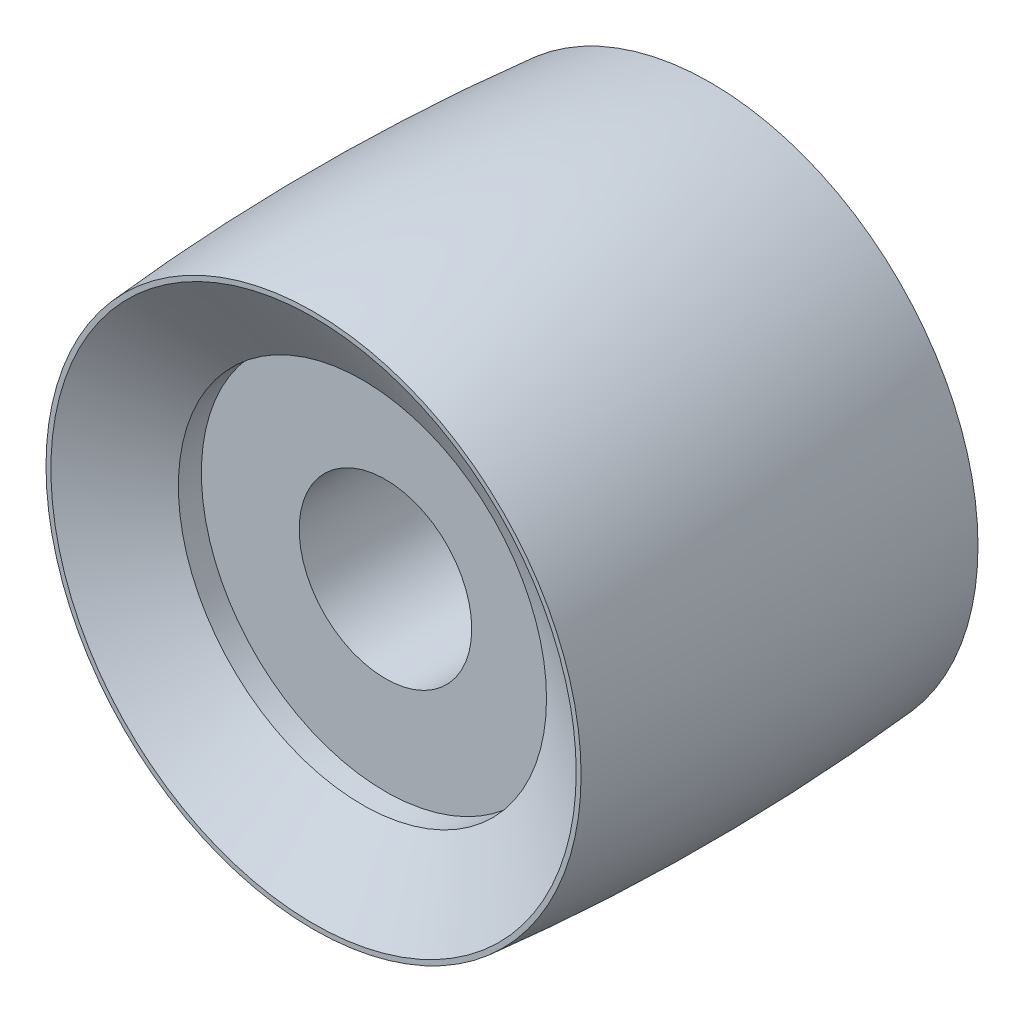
ISO-10303-21;
HEADER;
FILE_DESCRIPTION(('STEP AP214'),'2;1');
FILE_NAME('part.step','',(''),(''),'','','');
FILE_SCHEMA(('AUTOMOTIVE_DESIGN { 1 0 10303 214 1 1 1 1 }'));
ENDSEC;
DATA;
#1=APPLICATION_CONTEXT('core data for automotive mechanical design processes');
#2=APPLICATION_PROTOCOL_DEFINITION('international standard','automotive_design',2000,#1);
#3=PRODUCT_CONTEXT('',#1,'mechanical');
#4=PRODUCT('Part','Part','',(#3));
#5=PRODUCT_RELATED_PRODUCT_CATEGORY('part','',(#4));
#6=PRODUCT_DEFINITION_FORMATION('','',#4);
#7=PRODUCT_DEFINITION_CONTEXT('part definition',#1,'design');
#8=PRODUCT_DEFINITION('design','',#6,#7);
#9=PRODUCT_DEFINITION_SHAPE('','',#8);
#10=(LENGTH_UNIT() NAMED_UNIT(*) SI_UNIT(.MILLI.,.METRE.));
#11=(NAMED_UNIT(*) PLANE_ANGLE_UNIT() SI_UNIT($,.RADIAN.));
#12=(NAMED_UNIT(*) SI_UNIT($,.STERADIAN.) SOLID_ANGLE_UNIT());
#13=UNCERTAINTY_MEASURE_WITH_UNIT(LENGTH_MEASURE(1.E-05),#10,'distance_accuracy_value','');
#14=(GEOMETRIC_REPRESENTATION_CONTEXT(3) GLOBAL_UNCERTAINTY_ASSIGNED_CONTEXT((#13)) GLOBAL_UNIT_ASSIGNED_CONTEXT((#10,
#11,#12)) REPRESENTATION_CONTEXT('',''));
#15=CARTESIAN_POINT('',(0.,0.,0.));
#16=DIRECTION('',(0.,0.,1.));
#17=DIRECTION('',(1.,0.,0.));
#18=AXIS2_PLACEMENT_3D('',#15,#16,#17);
#19=CARTESIAN_POINT('',(0.,0.,0.));
#20=DIRECTION('',(0.,0.,1.));
#21=DIRECTION('',(1.,0.,0.));
#22=AXIS2_PLACEMENT_3D('',#19,#20,#21);
#23=DEGENERATE_TOROIDAL_SURFACE('',#22,176.000000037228,200.000000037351,.F.);
#24=CARTESIAN_POINT('',(0.,0.,17.2500000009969));
#25=DIRECTION('',(0.,0.,1.));
#26=DIRECTION('',(1.,0.,0.));
#27=AXIS2_PLACEMENT_3D('',#24,#25,#26);
#28=CIRCLE('',#27,23.2547050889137);
#29=CARTESIAN_POINT('',(23.2547050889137,0.,17.2500000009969));
#30=VERTEX_POINT('',#29);
#31=EDGE_CURVE('E16',#30,#30,#28,.F.);
#32=ORIENTED_EDGE('',*,*,#31,.T.);
#33=EDGE_LOOP('',(#32));
#34=FACE_BOUND('',#33,.T.);
#35=CARTESIAN_POINT('',(0.,0.,-17.2500000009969));
#36=DIRECTION('',(0.,0.,1.));
#37=DIRECTION('',(1.,0.,0.));
#38=AXIS2_PLACEMENT_3D('',#35,#36,#37);
#39=CIRCLE('',#38,23.2547050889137);
#40=CARTESIAN_POINT('',(23.2547050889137,0.,-17.2500000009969));
#41=VERTEX_POINT('',#40);
#42=EDGE_CURVE('E42',#41,#41,#39,.T.);
#43=ORIENTED_EDGE('',*,*,#42,.T.);
#44=EDGE_LOOP('',(#43));
#45=FACE_BOUND('',#44,.T.);
#46=ADVANCED_FACE('F12',(#34,#45),#23,.F.);
#47=CARTESIAN_POINT('',(23.53376155,-23.614740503,17.25));
#48=DIRECTION('',(0.,0.,-1.));
#49=DIRECTION('',(-1.,0.,0.));
#50=AXIS2_PLACEMENT_3D('',#47,#48,#49);
#51=PLANE('',#50);
#52=CARTESIAN_POINT('',(0.,0.,17.25));
#53=DIRECTION('',(0.,0.,1.));
#54=DIRECTION('',(1.,0.,0.));
#55=AXIS2_PLACEMENT_3D('',#52,#53,#54);
#56=CIRCLE('',#55,22.830357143);
#57=CARTESIAN_POINT('',(22.830357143,0.,17.25));
#58=VERTEX_POINT('',#57);
#59=EDGE_CURVE('E40',#58,#58,#56,.F.);
#60=ORIENTED_EDGE('',*,*,#59,.T.);
#61=EDGE_LOOP('',(#60));
#62=FACE_BOUND('',#61,.T.);
#63=ORIENTED_EDGE('',*,*,#31,.F.);
#64=EDGE_LOOP('',(#63));
#65=FACE_BOUND('',#64,.T.);
#66=ADVANCED_FACE('F50',(#62,#65),#51,.F.);
#67=CARTESIAN_POINT('',(-23.53376155,-23.614740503,-17.25));
#68=DIRECTION('',(0.,0.,1.));
#69=DIRECTION('',(1.,0.,0.));
#70=AXIS2_PLACEMENT_3D('',#67,#68,#69);
#71=PLANE('',#70);
#72=CARTESIAN_POINT('',(0.,0.,-17.25));
#73=DIRECTION('',(0.,0.,-1.));
#74=DIRECTION('',(-1.,0.,0.));
#75=AXIS2_PLACEMENT_3D('',#72,#73,#74);
#76=CIRCLE('',#75,22.830357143);
#77=CARTESIAN_POINT('',(-22.830357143,0.,-17.25));
#78=VERTEX_POINT('',#77);
#79=EDGE_CURVE('E37',#78,#78,#76,.F.);
#80=ORIENTED_EDGE('',*,*,#79,.T.);
#81=EDGE_LOOP('',(#80));
#82=FACE_BOUND('',#81,.T.);
#83=ORIENTED_EDGE('',*,*,#42,.F.);
#84=EDGE_LOOP('',(#83));
#85=FACE_BOUND('',#84,.T.);
#86=ADVANCED_FACE('F52',(#82,#85),#71,.F.);
#87=CARTESIAN_POINT('',(0.,0.,13.));
#88=DIRECTION('',(0.,0.,1.));
#89=DIRECTION('',(1.,0.,0.));
#90=AXIS2_PLACEMENT_3D('',#87,#88,#89);
#91=CONICAL_SURFACE('',#90,16.,1.01419700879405);
#92=CARTESIAN_POINT('',(0.,0.,13.));
#93=DIRECTION('',(0.,0.,1.));
#94=DIRECTION('',(1.,0.,0.));
#95=AXIS2_PLACEMENT_3D('',#92,#93,#94);
#96=CIRCLE('',#95,16.);
#97=CARTESIAN_POINT('',(16.,0.,13.));
#98=VERTEX_POINT('',#97);
#99=EDGE_CURVE('E28',#98,#98,#96,.F.);
#100=ORIENTED_EDGE('',*,*,#99,.T.);
#101=EDGE_LOOP('',(#100));
#102=FACE_BOUND('',#101,.T.);
#103=ORIENTED_EDGE('',*,*,#59,.F.);
#104=EDGE_LOOP('',(#103));
#105=FACE_BOUND('',#104,.T.);
#106=ADVANCED_FACE('F61',(#102,#105),#91,.F.);
#107=CARTESIAN_POINT('',(0.,0.,-13.));
#108=DIRECTION('',(0.,0.,-1.));
#109=DIRECTION('',(-1.,0.,0.));
#110=AXIS2_PLACEMENT_3D('',#107,#108,#109);
#111=CONICAL_SURFACE('',#110,16.,1.01419700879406);
#112=CARTESIAN_POINT('',(0.,0.,-13.));
#113=DIRECTION('',(0.,0.,1.));
#114=DIRECTION('',(1.,0.,0.));
#115=AXIS2_PLACEMENT_3D('',#112,#113,#114);
#116=CIRCLE('',#115,16.);
#117=CARTESIAN_POINT('',(16.,0.,-13.));
#118=VERTEX_POINT('',#117);
#119=EDGE_CURVE('E36',#118,#118,#116,.T.);
#120=ORIENTED_EDGE('',*,*,#119,.T.);
#121=EDGE_LOOP('',(#120));
#122=FACE_BOUND('',#121,.T.);
#123=ORIENTED_EDGE('',*,*,#79,.F.);
#124=EDGE_LOOP('',(#123));
#125=FACE_BOUND('',#124,.T.);
#126=ADVANCED_FACE('F84',(#122,#125),#111,.F.);
#127=CARTESIAN_POINT('',(0.,0.,11.));
#128=DIRECTION('',(0.,0.,1.));
#129=DIRECTION('',(1.,0.,0.));
#130=AXIS2_PLACEMENT_3D('',#127,#128,#129);
#131=CYLINDRICAL_SURFACE('',#130,16.);
#132=CARTESIAN_POINT('',(0.,0.,11.));
#133=DIRECTION('',(0.,0.,1.));
#134=DIRECTION('',(1.,0.,0.));
#135=AXIS2_PLACEMENT_3D('',#132,#133,#134);
#136=CIRCLE('',#135,16.);
#137=CARTESIAN_POINT('',(16.,0.,11.));
#138=VERTEX_POINT('',#137);
#139=EDGE_CURVE('E33',#138,#138,#136,.F.);
#140=ORIENTED_EDGE('',*,*,#139,.T.);
#141=EDGE_LOOP('',(#140));
#142=FACE_BOUND('',#141,.T.);
#143=ORIENTED_EDGE('',*,*,#99,.F.);
#144=EDGE_LOOP('',(#143));
#145=FACE_BOUND('',#144,.T.);
#146=ADVANCED_FACE('F80',(#142,#145),#131,.F.);
#147=CARTESIAN_POINT('',(0.,0.,-13.));
#148=DIRECTION('',(0.,0.,1.));
#149=DIRECTION('',(1.,0.,0.));
#150=AXIS2_PLACEMENT_3D('',#147,#148,#149);
#151=CYLINDRICAL_SURFACE('',#150,16.);
#152=ORIENTED_EDGE('',*,*,#119,.F.);
#153=EDGE_LOOP('',(#152));
#154=FACE_BOUND('',#153,.T.);
#155=CARTESIAN_POINT('',(0.,0.,-11.));
#156=DIRECTION('',(0.,0.,1.));
#157=DIRECTION('',(1.,0.,0.));
#158=AXIS2_PLACEMENT_3D('',#155,#156,#157);
#159=CIRCLE('',#158,16.);
#160=CARTESIAN_POINT('',(16.,0.,-11.));
#161=VERTEX_POINT('',#160);
#162=EDGE_CURVE('E25',#161,#161,#159,.T.);
#163=ORIENTED_EDGE('',*,*,#162,.T.);
#164=EDGE_LOOP('',(#163));
#165=FACE_BOUND('',#164,.T.);
#166=ADVANCED_FACE('F77',(#154,#165),#151,.F.);
#167=CARTESIAN_POINT('',(16.192,-16.247716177,11.));
#168=DIRECTION('',(0.,0.,-1.));
#169=DIRECTION('',(-1.,0.,0.));
#170=AXIS2_PLACEMENT_3D('',#167,#168,#169);
#171=PLANE('',#170);
#172=CARTESIAN_POINT('',(0.,0.,11.));
#173=DIRECTION('',(0.,0.,1.));
#174=DIRECTION('',(1.,0.,0.));
#175=AXIS2_PLACEMENT_3D('',#172,#173,#174);
#176=CIRCLE('',#175,7.5);
#177=CARTESIAN_POINT('',(7.5,0.,11.));
#178=VERTEX_POINT('',#177);
#179=EDGE_CURVE('E20',#178,#178,#176,.F.);
#180=ORIENTED_EDGE('',*,*,#179,.T.);
#181=EDGE_LOOP('',(#180));
#182=FACE_BOUND('',#181,.T.);
#183=ORIENTED_EDGE('',*,*,#139,.F.);
#184=EDGE_LOOP('',(#183));
#185=FACE_BOUND('',#184,.T.);
#186=ADVANCED_FACE('F73',(#182,#185),#171,.F.);
#187=CARTESIAN_POINT('',(-16.192,-16.247716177,-11.));
#188=DIRECTION('',(0.,0.,1.));
#189=DIRECTION('',(1.,0.,0.));
#190=AXIS2_PLACEMENT_3D('',#187,#188,#189);
#191=PLANE('',#190);
#192=CARTESIAN_POINT('',(0.,0.,-11.));
#193=DIRECTION('',(0.,0.,1.));
#194=DIRECTION('',(1.,0.,0.));
#195=AXIS2_PLACEMENT_3D('',#192,#193,#194);
#196=CIRCLE('',#195,7.5);
#197=CARTESIAN_POINT('',(7.5,0.,-11.));
#198=VERTEX_POINT('',#197);
#199=EDGE_CURVE('E8',#198,#198,#196,.T.);
#200=ORIENTED_EDGE('',*,*,#199,.T.);
#201=EDGE_LOOP('',(#200));
#202=FACE_BOUND('',#201,.T.);
#203=ORIENTED_EDGE('',*,*,#162,.F.);
#204=EDGE_LOOP('',(#203));
#205=FACE_BOUND('',#204,.T.);
#206=ADVANCED_FACE('F14',(#202,#205),#191,.F.);
#207=CARTESIAN_POINT('',(0.,0.,-11.));
#208=DIRECTION('',(0.,0.,1.));
#209=DIRECTION('',(1.,0.,0.));
#210=AXIS2_PLACEMENT_3D('',#207,#208,#209);
#211=CYLINDRICAL_SURFACE('',#210,7.5);
#212=ORIENTED_EDGE('',*,*,#179,.F.);
#213=EDGE_LOOP('',(#212));
#214=FACE_BOUND('',#213,.T.);
#215=ORIENTED_EDGE('',*,*,#199,.F.);
#216=EDGE_LOOP('',(#215));
#217=FACE_BOUND('',#216,.T.);
#218=ADVANCED_FACE('F65',(#214,#217),#211,.F.);
#219=CLOSED_SHELL('',(#46,#66,#86,#106,#126,#146,#166,#186,#206,#218));
#220=MANIFOLD_SOLID_BREP('B1',#219);
#221=ADVANCED_BREP_SHAPE_REPRESENTATION('',(#18,#220),#14);
#222=SHAPE_DEFINITION_REPRESENTATION(#9,#221);
ENDSEC;
END-ISO-10303-21;
